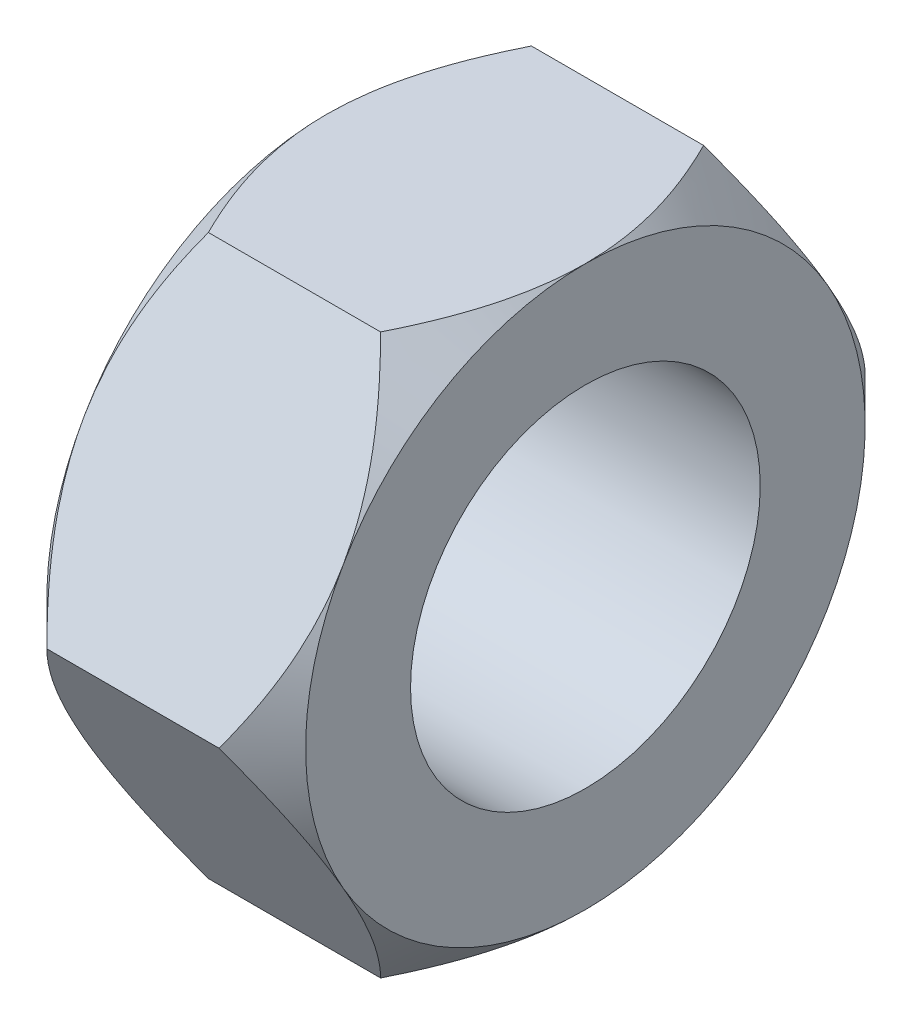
ISO-10303-21;
HEADER;
FILE_DESCRIPTION(('STEP AP214'),'2;1');
FILE_NAME('part.step','',(''),(''),'','','');
FILE_SCHEMA(('AUTOMOTIVE_DESIGN { 1 0 10303 214 1 1 1 1 }'));
ENDSEC;
DATA;
#1=APPLICATION_CONTEXT('core data for automotive mechanical design processes');
#2=APPLICATION_PROTOCOL_DEFINITION('international standard','automotive_design',2000,#1);
#3=PRODUCT_CONTEXT('',#1,'mechanical');
#4=PRODUCT('Part','Part','',(#3));
#5=PRODUCT_RELATED_PRODUCT_CATEGORY('part','',(#4));
#6=PRODUCT_DEFINITION_FORMATION('','',#4);
#7=PRODUCT_DEFINITION_CONTEXT('part definition',#1,'design');
#8=PRODUCT_DEFINITION('design','',#6,#7);
#9=PRODUCT_DEFINITION_SHAPE('','',#8);
#10=(LENGTH_UNIT() NAMED_UNIT(*) SI_UNIT(.MILLI.,.METRE.));
#11=(NAMED_UNIT(*) PLANE_ANGLE_UNIT() SI_UNIT($,.RADIAN.));
#12=(NAMED_UNIT(*) SI_UNIT($,.STERADIAN.) SOLID_ANGLE_UNIT());
#13=UNCERTAINTY_MEASURE_WITH_UNIT(LENGTH_MEASURE(1.E-05),#10,'distance_accuracy_value','');
#14=(GEOMETRIC_REPRESENTATION_CONTEXT(3) GLOBAL_UNCERTAINTY_ASSIGNED_CONTEXT((#13)) GLOBAL_UNIT_ASSIGNED_CONTEXT((#10,
#11,#12)) REPRESENTATION_CONTEXT('',''));
#15=CARTESIAN_POINT('',(0.,0.,0.));
#16=DIRECTION('',(0.,0.,1.));
#17=DIRECTION('',(1.,0.,0.));
#18=AXIS2_PLACEMENT_3D('',#15,#16,#17);
#19=CARTESIAN_POINT('',(0.,0.,0.));
#20=DIRECTION('',(1.,0.,0.));
#21=DIRECTION('',(0.,1.,0.));
#22=AXIS2_PLACEMENT_3D('',#19,#20,#21);
#23=PLANE('',#22);
#24=CARTESIAN_POINT('',(0.,-1.04645777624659E-12,-0.00155281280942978));
#25=DIRECTION('',(1.,0.,0.));
#26=DIRECTION('',(0.,-1.,0.));
#27=AXIS2_PLACEMENT_3D('',#24,#25,#26);
#28=CIRCLE('',#27,4.);
#29=CARTESIAN_POINT('',(0.,-4.00000000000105,-0.00155281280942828));
#30=VERTEX_POINT('',#29);
#31=CARTESIAN_POINT('',(0.,-2.00000000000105,-3.46565442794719));
#32=VERTEX_POINT('',#31);
#33=EDGE_CURVE('E576',#30,#32,#28,.T.);
#34=ORIENTED_EDGE('',*,*,#33,.F.);
#35=CARTESIAN_POINT('',(0.,-1.04645777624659E-12,-0.00155281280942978));
#36=DIRECTION('',(-1.,0.,0.));
#37=DIRECTION('',(0.,-1.,0.));
#38=AXIS2_PLACEMENT_3D('',#35,#36,#37);
#39=CIRCLE('',#38,4.);
#40=CARTESIAN_POINT('',(0.,-2.00000000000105,3.46254880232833));
#41=VERTEX_POINT('',#40);
#42=EDGE_CURVE('E11',#30,#41,#39,.T.);
#43=ORIENTED_EDGE('',*,*,#42,.T.);
#44=CARTESIAN_POINT('',(0.,-1.04645777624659E-12,-0.00155281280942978));
#45=DIRECTION('',(1.,0.,0.));
#46=DIRECTION('',(0.,-1.,0.));
#47=AXIS2_PLACEMENT_3D('',#44,#45,#46);
#48=CIRCLE('',#47,4.);
#49=CARTESIAN_POINT('',(0.,1.99999999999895,3.46254880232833));
#50=VERTEX_POINT('',#49);
#51=EDGE_CURVE('E32',#50,#41,#48,.T.);
#52=ORIENTED_EDGE('',*,*,#51,.F.);
#53=CARTESIAN_POINT('',(0.,-1.04645777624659E-12,-0.00155281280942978));
#54=DIRECTION('',(1.,0.,0.));
#55=DIRECTION('',(0.,-1.,0.));
#56=AXIS2_PLACEMENT_3D('',#53,#54,#55);
#57=CIRCLE('',#56,4.);
#58=CARTESIAN_POINT('',(0.,3.99999999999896,-0.00155281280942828));
#59=VERTEX_POINT('',#58);
#60=EDGE_CURVE('E130',#59,#50,#57,.T.);
#61=ORIENTED_EDGE('',*,*,#60,.F.);
#62=CARTESIAN_POINT('',(0.,-1.04645777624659E-12,-0.00155281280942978));
#63=DIRECTION('',(1.,0.,0.));
#64=DIRECTION('',(0.,-1.,0.));
#65=AXIS2_PLACEMENT_3D('',#62,#63,#64);
#66=CIRCLE('',#65,4.);
#67=CARTESIAN_POINT('',(0.,1.99999999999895,-3.46565442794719));
#68=VERTEX_POINT('',#67);
#69=EDGE_CURVE('E143',#68,#59,#66,.T.);
#70=ORIENTED_EDGE('',*,*,#69,.F.);
#71=CARTESIAN_POINT('',(0.,-1.04645777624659E-12,-0.00155281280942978));
#72=DIRECTION('',(1.,0.,0.));
#73=DIRECTION('',(0.,-1.,0.));
#74=AXIS2_PLACEMENT_3D('',#71,#72,#73);
#75=CIRCLE('',#74,4.);
#76=EDGE_CURVE('E579',#32,#68,#75,.T.);
#77=ORIENTED_EDGE('',*,*,#76,.F.);
#78=EDGE_LOOP('',(#34,#43,#52,#61,#70,#77));
#79=FACE_BOUND('',#78,.T.);
#80=CARTESIAN_POINT('',(0.,-1.04645777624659E-12,-0.00155281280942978));
#81=DIRECTION('',(1.,0.,0.));
#82=DIRECTION('',(0.,1.,0.));
#83=AXIS2_PLACEMENT_3D('',#80,#81,#82);
#84=CIRCLE('',#83,2.5);
#85=CARTESIAN_POINT('',(0.,2.49999999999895,-0.00155281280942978));
#86=VERTEX_POINT('',#85);
#87=EDGE_CURVE('E25',#86,#86,#84,.F.);
#88=ORIENTED_EDGE('',*,*,#87,.F.);
#89=EDGE_LOOP('',(#88));
#90=FACE_BOUND('',#89,.T.);
#91=ADVANCED_FACE('F17',(#79,#90),#23,.F.);
#92=CARTESIAN_POINT('',(3.69999999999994,-1.04645777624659E-12,-0.00155281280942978));
#93=DIRECTION('',(-1.,0.,0.));
#94=DIRECTION('',(0.,-1.,0.));
#95=AXIS2_PLACEMENT_3D('',#92,#93,#94);
#96=CONICAL_SURFACE('',#95,4.,0.78539816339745);
#97=CARTESIAN_POINT('',(3.69999999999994,-1.04645777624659E-12,-0.00155281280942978));
#98=DIRECTION('',(1.,0.,0.));
#99=DIRECTION('',(0.,-1.,0.));
#100=AXIS2_PLACEMENT_3D('',#97,#98,#99);
#101=CIRCLE('',#100,4.);
#102=CARTESIAN_POINT('',(3.69999999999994,-4.00000000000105,-0.00155281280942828));
#103=VERTEX_POINT('',#102);
#104=CARTESIAN_POINT('',(3.69999999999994,-2.00000000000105,-3.46565442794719));
#105=VERTEX_POINT('',#104);
#106=EDGE_CURVE('E266',#103,#105,#101,.T.);
#107=ORIENTED_EDGE('',*,*,#106,.F.);
#108=CARTESIAN_POINT('',(3.08119784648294,-4.00000000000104,-2.31095388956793));
#109=CARTESIAN_POINT('',(3.37530243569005,-4.00000000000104,-1.72274471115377));
#110=CARTESIAN_POINT('',(3.52696563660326,-4.00000000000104,-1.19076086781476));
#111=CARTESIAN_POINT('',(3.69999999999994,-4.00000000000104,-0.583814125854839));
#112=CARTESIAN_POINT('',(3.69999999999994,-4.00000000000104,-0.00155281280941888));
#113=B_SPLINE_CURVE_WITH_KNOTS('',2,(#108,#109,#110,#111,#112),.UNSPECIFIED.,.F.,.F.,(3,2,3),
(0.,0.5,1.),.UNSPECIFIED.);
#114=CARTESIAN_POINT('',(3.08119784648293,-4.00000000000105,-2.31095388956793));
#115=VERTEX_POINT('',#114);
#116=EDGE_CURVE('E319',#115,#103,#113,.T.);
#117=ORIENTED_EDGE('',*,*,#116,.F.);
#118=CARTESIAN_POINT('',(3.69999999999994,-2.00000000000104,-3.46565442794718));
#119=CARTESIAN_POINT('',(3.69999999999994,-2.50249959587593,-3.17553615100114));
#120=CARTESIAN_POINT('',(3.52789189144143,-3.02706599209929,-2.87267760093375));
#121=CARTESIAN_POINT('',(3.3764771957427,-3.48856116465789,-2.60623323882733));
#122=CARTESIAN_POINT('',(3.08119784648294,-4.00000000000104,-2.31095388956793));
#123=B_SPLINE_CURVE_WITH_KNOTS('',2,(#118,#119,#120,#121,#122),.UNSPECIFIED.,.F.,.F.,(3,2,3),
(0.,0.5,1.),.UNSPECIFIED.);
#124=EDGE_CURVE('E326',#105,#115,#123,.T.);
#125=ORIENTED_EDGE('',*,*,#124,.F.);
#126=EDGE_LOOP('',(#107,#117,#125));
#127=FACE_BOUND('',#126,.T.);
#128=ADVANCED_FACE('F189',(#127),#96,.T.);
#129=CARTESIAN_POINT('',(3.69999999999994,-1.04645777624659E-12,-0.00155281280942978));
#130=DIRECTION('',(-1.,0.,0.));
#131=DIRECTION('',(0.,-1.,0.));
#132=AXIS2_PLACEMENT_3D('',#129,#130,#131);
#133=CONICAL_SURFACE('',#132,4.,0.78539816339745);
#134=CARTESIAN_POINT('',(3.69999999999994,1.99999999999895,-3.4656544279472));
#135=CARTESIAN_POINT('',(3.69999999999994,1.49750040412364,-3.75577270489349));
#136=CARTESIAN_POINT('',(3.52789189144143,0.97293400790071,-4.05863125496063));
#137=CARTESIAN_POINT('',(3.37647719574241,0.511438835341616,-4.32507561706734));
#138=CARTESIAN_POINT('',(3.08119784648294,-1.04213512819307E-12,-4.62035496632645));
#139=B_SPLINE_CURVE_WITH_KNOTS('',2,(#134,#135,#136,#137,#138),.UNSPECIFIED.,.F.,.F.,(3,2,3),
(0.,0.5,1.),.UNSPECIFIED.);
#140=CARTESIAN_POINT('',(3.69999999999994,1.99999999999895,-3.46565442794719));
#141=VERTEX_POINT('',#140);
#142=CARTESIAN_POINT('',(3.08119784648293,-1.04515673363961E-12,-4.62035496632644));
#143=VERTEX_POINT('',#142);
#144=EDGE_CURVE('E270',#141,#143,#139,.T.);
#145=ORIENTED_EDGE('',*,*,#144,.F.);
#146=CARTESIAN_POINT('',(3.69999999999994,-1.04645777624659E-12,-0.00155281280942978));
#147=DIRECTION('',(1.,0.,0.));
#148=DIRECTION('',(0.,-1.,0.));
#149=AXIS2_PLACEMENT_3D('',#146,#147,#148);
#150=CIRCLE('',#149,4.);
#151=EDGE_CURVE('E262',#105,#141,#150,.T.);
#152=ORIENTED_EDGE('',*,*,#151,.F.);
#153=CARTESIAN_POINT('',(3.08119784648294,-1.04343617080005E-12,-4.62035496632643));
#154=CARTESIAN_POINT('',(3.37420546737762,-0.507504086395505,-4.32734734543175));
#155=CARTESIAN_POINT('',(3.525810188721,-0.966609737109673,-4.06228257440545));
#156=CARTESIAN_POINT('',(3.69999999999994,-1.4941099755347,-3.75773016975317));
#157=CARTESIAN_POINT('',(3.69999999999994,-2.00000000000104,-3.46565442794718));
#158=B_SPLINE_CURVE_WITH_KNOTS('',2,(#153,#154,#155,#156,#157),.UNSPECIFIED.,.F.,.F.,(3,2,3),
(0.,0.5,1.),.UNSPECIFIED.);
#159=EDGE_CURVE('E331',#143,#105,#158,.T.);
#160=ORIENTED_EDGE('',*,*,#159,.F.);
#161=EDGE_LOOP('',(#145,#152,#160));
#162=FACE_BOUND('',#161,.T.);
#163=ADVANCED_FACE('F394',(#162),#133,.T.);
#164=CARTESIAN_POINT('',(3.69999999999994,-1.04645777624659E-12,-0.00155281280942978));
#165=DIRECTION('',(-1.,0.,0.));
#166=DIRECTION('',(0.,-1.,0.));
#167=AXIS2_PLACEMENT_3D('',#164,#165,#166);
#168=CONICAL_SURFACE('',#167,4.,0.78539816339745);
#169=CARTESIAN_POINT('',(3.69999999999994,-1.04645777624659E-12,-0.00155281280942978));
#170=DIRECTION('',(1.,0.,0.));
#171=DIRECTION('',(0.,-1.,0.));
#172=AXIS2_PLACEMENT_3D('',#169,#170,#171);
#173=CIRCLE('',#172,4.);
#174=CARTESIAN_POINT('',(3.69999999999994,3.99999999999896,-0.00155281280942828));
#175=VERTEX_POINT('',#174);
#176=EDGE_CURVE('E258',#141,#175,#173,.T.);
#177=ORIENTED_EDGE('',*,*,#176,.F.);
#178=CARTESIAN_POINT('',(3.08119784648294,3.99999999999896,-2.31095388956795));
#179=CARTESIAN_POINT('',(3.37420546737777,3.49249591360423,-2.60396151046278));
#180=CARTESIAN_POINT('',(3.525810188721,3.03339026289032,-2.86902628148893));
#181=CARTESIAN_POINT('',(3.69999999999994,2.50589002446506,-3.17357868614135));
#182=CARTESIAN_POINT('',(3.69999999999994,1.99999999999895,-3.4656544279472));
#183=B_SPLINE_CURVE_WITH_KNOTS('',2,(#178,#179,#180,#181,#182),.UNSPECIFIED.,.F.,.F.,(3,2,3),
(0.,0.5,1.),.UNSPECIFIED.);
#184=CARTESIAN_POINT('',(3.08119784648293,3.99999999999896,-2.31095388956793));
#185=VERTEX_POINT('',#184);
#186=EDGE_CURVE('E275',#185,#141,#183,.T.);
#187=ORIENTED_EDGE('',*,*,#186,.F.);
#188=CARTESIAN_POINT('',(3.69999999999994,3.99999999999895,-0.00155281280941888));
#189=CARTESIAN_POINT('',(3.69999999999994,3.99999999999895,-0.58332473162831));
#190=CARTESIAN_POINT('',(3.52696563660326,3.99999999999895,-1.19076086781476));
#191=CARTESIAN_POINT('',(3.37558641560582,3.99999999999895,-1.72217675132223));
#192=CARTESIAN_POINT('',(3.08119784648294,3.99999999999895,-2.31095388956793));
#193=B_SPLINE_CURVE_WITH_KNOTS('',2,(#188,#189,#190,#191,#192),.UNSPECIFIED.,.F.,.F.,(3,2,3),
(0.,0.5,1.),.UNSPECIFIED.);
#194=EDGE_CURVE('E282',#175,#185,#193,.T.);
#195=ORIENTED_EDGE('',*,*,#194,.F.);
#196=EDGE_LOOP('',(#177,#187,#195));
#197=FACE_BOUND('',#196,.T.);
#198=ADVANCED_FACE('F403',(#197),#168,.T.);
#199=CARTESIAN_POINT('',(3.69999999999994,-1.04645777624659E-12,-0.00155281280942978));
#200=DIRECTION('',(-1.,0.,0.));
#201=DIRECTION('',(0.,-1.,0.));
#202=AXIS2_PLACEMENT_3D('',#199,#200,#201);
#203=CONICAL_SURFACE('',#202,4.,0.78539816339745);
#204=CARTESIAN_POINT('',(3.69999999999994,-1.04645777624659E-12,-0.00155281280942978));
#205=DIRECTION('',(1.,0.,0.));
#206=DIRECTION('',(0.,-1.,0.));
#207=AXIS2_PLACEMENT_3D('',#204,#205,#206);
#208=CIRCLE('',#207,4.);
#209=CARTESIAN_POINT('',(3.69999999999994,1.99999999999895,3.46254880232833));
#210=VERTEX_POINT('',#209);
#211=EDGE_CURVE('E254',#175,#210,#208,.T.);
#212=ORIENTED_EDGE('',*,*,#211,.F.);
#213=CARTESIAN_POINT('',(3.08119784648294,3.99999999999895,2.30784826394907));
#214=CARTESIAN_POINT('',(3.3755036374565,3.99999999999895,1.71923668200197));
#215=CARTESIAN_POINT('',(3.52717771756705,3.99999999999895,1.18691081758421));
#216=CARTESIAN_POINT('',(3.69999999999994,3.99999999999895,0.580361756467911));
#217=CARTESIAN_POINT('',(3.69999999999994,3.99999999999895,-0.00155281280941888));
#218=B_SPLINE_CURVE_WITH_KNOTS('',2,(#213,#214,#215,#216,#217),.UNSPECIFIED.,.F.,.F.,(3,2,3),
(0.,0.5,1.),.UNSPECIFIED.);
#219=CARTESIAN_POINT('',(3.08119784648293,3.99999999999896,2.30784826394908));
#220=VERTEX_POINT('',#219);
#221=EDGE_CURVE('E287',#220,#175,#218,.T.);
#222=ORIENTED_EDGE('',*,*,#221,.F.);
#223=CARTESIAN_POINT('',(3.69999999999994,1.99999999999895,3.46254880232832));
#224=CARTESIAN_POINT('',(3.69999999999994,2.50249959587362,3.1724305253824));
#225=CARTESIAN_POINT('',(3.52789189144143,3.0270659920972,2.86957197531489));
#226=CARTESIAN_POINT('',(3.37647719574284,3.48856116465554,2.60312761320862));
#227=CARTESIAN_POINT('',(3.08119784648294,3.99999999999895,2.30784826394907));
#228=B_SPLINE_CURVE_WITH_KNOTS('',2,(#223,#224,#225,#226,#227),.UNSPECIFIED.,.F.,.F.,(3,2,3),
(0.,0.5,1.),.UNSPECIFIED.);
#229=EDGE_CURVE('E293',#210,#220,#228,.T.);
#230=ORIENTED_EDGE('',*,*,#229,.F.);
#231=EDGE_LOOP('',(#212,#222,#230));
#232=FACE_BOUND('',#231,.T.);
#233=ADVANCED_FACE('F411',(#232),#203,.T.);
#234=CARTESIAN_POINT('',(3.69999999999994,-1.04645777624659E-12,-0.00155281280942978));
#235=DIRECTION('',(-1.,0.,0.));
#236=DIRECTION('',(0.,-1.,0.));
#237=AXIS2_PLACEMENT_3D('',#234,#235,#236);
#238=CONICAL_SURFACE('',#237,4.,0.78539816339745);
#239=CARTESIAN_POINT('',(3.69999999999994,-1.04645777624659E-12,-0.00155281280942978));
#240=DIRECTION('',(1.,0.,0.));
#241=DIRECTION('',(0.,-1.,0.));
#242=AXIS2_PLACEMENT_3D('',#239,#240,#241);
#243=CIRCLE('',#242,4.);
#244=CARTESIAN_POINT('',(3.69999999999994,-2.00000000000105,3.46254880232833));
#245=VERTEX_POINT('',#244);
#246=EDGE_CURVE('E249',#210,#245,#243,.T.);
#247=ORIENTED_EDGE('',*,*,#246,.F.);
#248=CARTESIAN_POINT('',(3.08119784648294,-1.04950770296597E-12,4.61724934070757));
#249=CARTESIAN_POINT('',(3.37420546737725,0.507504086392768,4.32424171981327));
#250=CARTESIAN_POINT('',(3.525810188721,0.966609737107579,4.05917694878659));
#251=CARTESIAN_POINT('',(3.69999999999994,1.49410997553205,3.75462454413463));
#252=CARTESIAN_POINT('',(3.69999999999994,1.99999999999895,3.46254880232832));
#253=B_SPLINE_CURVE_WITH_KNOTS('',2,(#248,#249,#250,#251,#252),.UNSPECIFIED.,.F.,.F.,(3,2,3),
(0.,0.5,1.),.UNSPECIFIED.);
#254=CARTESIAN_POINT('',(3.08119784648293,-1.04656480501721E-12,4.61724934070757));
#255=VERTEX_POINT('',#254);
#256=EDGE_CURVE('E297',#255,#210,#253,.T.);
#257=ORIENTED_EDGE('',*,*,#256,.F.);
#258=CARTESIAN_POINT('',(3.69999999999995,-2.00000000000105,3.46254880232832));
#259=CARTESIAN_POINT('',(3.69999999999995,-1.49750040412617,3.75266707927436));
#260=CARTESIAN_POINT('',(3.52789189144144,-0.972934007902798,4.05552562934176));
#261=CARTESIAN_POINT('',(3.37647719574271,-0.511438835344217,4.32196999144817));
#262=CARTESIAN_POINT('',(3.08119784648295,-1.05037506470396E-12,4.61724934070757));
#263=B_SPLINE_CURVE_WITH_KNOTS('',2,(#258,#259,#260,#261,#262),.UNSPECIFIED.,.F.,.F.,(3,2,3),
(0.,0.5,1.),.UNSPECIFIED.);
#264=EDGE_CURVE('E303',#245,#255,#263,.T.);
#265=ORIENTED_EDGE('',*,*,#264,.F.);
#266=EDGE_LOOP('',(#247,#257,#265));
#267=FACE_BOUND('',#266,.T.);
#268=ADVANCED_FACE('F420',(#267),#238,.T.);
#269=CARTESIAN_POINT('',(3.69999999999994,-1.04645777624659E-12,-0.00155281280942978));
#270=DIRECTION('',(-1.,0.,0.));
#271=DIRECTION('',(0.,-1.,0.));
#272=AXIS2_PLACEMENT_3D('',#269,#270,#271);
#273=CONICAL_SURFACE('',#272,4.,0.78539816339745);
#274=CARTESIAN_POINT('',(3.69999999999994,-1.04645777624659E-12,-0.00155281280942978));
#275=DIRECTION('',(-1.,0.,0.));
#276=DIRECTION('',(0.,-1.,0.));
#277=AXIS2_PLACEMENT_3D('',#274,#275,#276);
#278=CIRCLE('',#277,4.);
#279=EDGE_CURVE('E241',#103,#245,#278,.T.);
#280=ORIENTED_EDGE('',*,*,#279,.T.);
#281=CARTESIAN_POINT('',(3.08119784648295,-4.00000000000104,2.30784826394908));
#282=CARTESIAN_POINT('',(3.37420546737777,-3.49249591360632,2.60085588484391));
#283=CARTESIAN_POINT('',(3.52581018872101,-3.03339026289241,2.86592065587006));
#284=CARTESIAN_POINT('',(3.69999999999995,-2.50589002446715,3.17047306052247));
#285=CARTESIAN_POINT('',(3.69999999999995,-2.00000000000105,3.46254880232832));
#286=B_SPLINE_CURVE_WITH_KNOTS('',2,(#281,#282,#283,#284,#285),.UNSPECIFIED.,.F.,.F.,(3,2,3),
(0.,0.5,1.),.UNSPECIFIED.);
#287=CARTESIAN_POINT('',(3.08119784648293,-4.00000000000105,2.30784826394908));
#288=VERTEX_POINT('',#287);
#289=EDGE_CURVE('E307',#288,#245,#286,.T.);
#290=ORIENTED_EDGE('',*,*,#289,.F.);
#291=CARTESIAN_POINT('',(3.69999999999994,-4.00000000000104,-0.00155281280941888));
#292=CARTESIAN_POINT('',(3.69999999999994,-4.00000000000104,0.579865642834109));
#293=CARTESIAN_POINT('',(3.52717771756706,-4.00000000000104,1.18691081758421));
#294=CARTESIAN_POINT('',(3.37579150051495,-4.00000000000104,1.71866095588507));
#295=CARTESIAN_POINT('',(3.08119784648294,-4.00000000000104,2.30784826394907));
#296=B_SPLINE_CURVE_WITH_KNOTS('',2,(#291,#292,#293,#294,#295),.UNSPECIFIED.,.F.,.F.,(3,2,3),
(0.,0.5,1.),.UNSPECIFIED.);
#297=EDGE_CURVE('E314',#103,#288,#296,.T.);
#298=ORIENTED_EDGE('',*,*,#297,.F.);
#299=EDGE_LOOP('',(#280,#290,#298));
#300=FACE_BOUND('',#299,.T.);
#301=ADVANCED_FACE('F429',(#300),#273,.T.);
#302=CARTESIAN_POINT('',(0.,-2.17706036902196,-5.87728135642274));
#303=DIRECTION('',(0.,-0.5,0.866025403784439));
#304=DIRECTION('',(1.,0.,0.));
#305=AXIS2_PLACEMENT_3D('',#302,#303,#304);
#306=PLANE('',#305);
#307=CARTESIAN_POINT('',(0.618802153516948,3.99999999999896,-2.31095388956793));
#308=CARTESIAN_POINT('',(0.587203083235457,3.94526384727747,-2.34255546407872));
#309=CARTESIAN_POINT('',(0.556368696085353,3.89018646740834,-2.37434346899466));
#310=CARTESIAN_POINT('',(0.497184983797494,3.78071126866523,-2.43752122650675));
#311=CARTESIAN_POINT('',(0.468792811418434,3.72633086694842,-2.46890107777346));
#312=CARTESIAN_POINT('',(0.414489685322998,3.61815075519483,-2.53133367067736));
#313=CARTESIAN_POINT('',(0.388536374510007,3.56436696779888,-2.56237703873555));
#314=CARTESIAN_POINT('',(0.339111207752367,3.45727051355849,-2.62420626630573));
#315=CARTESIAN_POINT('',(0.315598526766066,3.40397187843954,-2.65498372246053));
#316=CARTESIAN_POINT('',(0.271052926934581,3.2977224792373,-2.71635038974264));
#317=CARTESIAN_POINT('',(0.249982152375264,3.24478354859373,-2.74693253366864));
#318=CARTESIAN_POINT('',(0.210315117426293,3.13911596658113,-2.80797079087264));
#319=CARTESIAN_POINT('',(0.191685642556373,3.08639671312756,-2.83842154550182));
#320=CARTESIAN_POINT('',(0.155582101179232,2.97701519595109,-2.90157598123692));
#321=CARTESIAN_POINT('',(0.138256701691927,2.92031526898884,-2.93429985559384));
#322=CARTESIAN_POINT('',(0.106675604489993,2.80724518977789,-2.9995697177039));
#323=CARTESIAN_POINT('',(0.0923750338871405,2.75088439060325,-3.03211010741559));
#324=CARTESIAN_POINT('',(0.066831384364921,2.63827553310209,-3.09713665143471));
#325=CARTESIAN_POINT('',(0.0555572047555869,2.58203273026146,-3.12961965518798));
#326=CARTESIAN_POINT('',(0.0356727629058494,2.46725558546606,-3.19588224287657));
#327=CARTESIAN_POINT('',(0.0271642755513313,2.40870754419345,-3.22966883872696));
#328=CARTESIAN_POINT('',(0.0135870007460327,2.29183246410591,-3.29713245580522));
#329=CARTESIAN_POINT('',(0.00848899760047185,2.2335079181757,-3.33080788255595));
#330=CARTESIAN_POINT('',(0.00168839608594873,2.11678963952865,-3.39820682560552));
#331=CARTESIAN_POINT('',(-1.85550231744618E-05,2.05839609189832,-3.43193022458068));
#332=CARTESIAN_POINT('',(0.,1.99999999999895,-3.46565442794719));
#333=B_SPLINE_CURVE_WITH_KNOTS('',3,(#307,#308,#309,#310,#311,#312,#313,#314,#315,#316,#317,
#318,#319,#320,#321,#322,#323,#324,#325,#326,#327,#328,#329,#330,#331,#332),.UNSPECIFIED.,.F.,
.F.,(4,2,2,2,2,2,2,2,2,2,2,2,4),(0.,0.211991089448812,0.418684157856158,0.620568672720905,
0.818190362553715,1.01215269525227,1.2031169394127,1.4062171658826,1.60605219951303,
1.8037473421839,2.0080584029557,2.21059603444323,2.41287352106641),.UNSPECIFIED.);
#334=CARTESIAN_POINT('',(0.618802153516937,3.99999999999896,-2.31095388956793));
#335=VERTEX_POINT('',#334);
#336=EDGE_CURVE('E158',#335,#68,#333,.T.);
#337=ORIENTED_EDGE('',*,*,#336,.F.);
#338=DIRECTION('',(1.,0.,0.));
#339=VECTOR('',#338,1.);
#340=CARTESIAN_POINT('',(0.,3.99999999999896,-2.31095388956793));
#341=LINE('',#340,#339);
#342=EDGE_CURVE('E279',#335,#185,#341,.T.);
#343=ORIENTED_EDGE('',*,*,#342,.T.);
#344=ORIENTED_EDGE('',*,*,#186,.T.);
#345=ORIENTED_EDGE('',*,*,#144,.T.);
#346=DIRECTION('',(1.,0.,0.));
#347=VECTOR('',#346,1.);
#348=CARTESIAN_POINT('',(0.,-1.04515673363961E-12,-4.62035496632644));
#349=LINE('',#348,#347);
#350=CARTESIAN_POINT('',(0.618802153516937,-1.04499051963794E-12,-4.62035496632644));
#351=VERTEX_POINT('',#350);
#352=EDGE_CURVE('E147',#351,#143,#349,.T.);
#353=ORIENTED_EDGE('',*,*,#352,.F.);
#354=CARTESIAN_POINT('',(0.,1.99999999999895,-3.46565442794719));
#355=CARTESIAN_POINT('',(-1.77233312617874E-05,1.94256608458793,-3.49880488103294));
#356=CARTESIAN_POINT('',(0.00164238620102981,1.88513951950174,-3.53196180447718));
#357=CARTESIAN_POINT('',(0.00824831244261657,1.77028547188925,-3.59829030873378));
#358=CARTESIAN_POINT('',(0.0132025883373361,1.71285836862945,-3.63146170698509));
#359=CARTESIAN_POINT('',(0.0263907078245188,1.59772186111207,-3.69797447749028));
#360=CARTESIAN_POINT('',(0.0346563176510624,1.54001523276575,-3.73131431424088));
#361=CARTESIAN_POINT('',(0.0541412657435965,1.42581369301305,-3.79724851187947));
#362=CARTESIAN_POINT('',(0.0653160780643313,1.36931333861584,-3.829846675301));
#363=CARTESIAN_POINT('',(0.0906757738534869,1.25624896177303,-3.89508684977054));
#364=CARTESIAN_POINT('',(0.104889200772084,1.19968978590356,-3.92772613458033));
#365=CARTESIAN_POINT('',(0.136310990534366,1.08628696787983,-3.99318801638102));
#366=CARTESIAN_POINT('',(0.153562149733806,1.02945238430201,-4.02600568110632));
#367=CARTESIAN_POINT('',(0.189615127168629,0.91958177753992,-4.089429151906));
#368=CARTESIAN_POINT('',(0.208275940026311,0.866511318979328,-4.12005587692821));
#369=CARTESIAN_POINT('',(0.248038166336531,0.760135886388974,-4.18143922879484));
#370=CARTESIAN_POINT('',(0.269173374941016,0.706840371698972,-4.21219031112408));
#371=CARTESIAN_POINT('',(0.313881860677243,0.599884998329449,-4.27391638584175));
#372=CARTESIAN_POINT('',(0.337493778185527,0.546237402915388,-4.30488456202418));
#373=CARTESIAN_POINT('',(0.387150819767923,0.438448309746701,-4.36712058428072));
#374=CARTESIAN_POINT('',(0.41323765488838,0.3843213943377,-4.39838032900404));
#375=CARTESIAN_POINT('',(0.467841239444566,0.275452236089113,-4.46126316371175));
#376=CARTESIAN_POINT('',(0.496401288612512,0.22072641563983,-4.49287696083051));
#377=CARTESIAN_POINT('',(0.555954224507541,0.110543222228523,-4.55652085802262));
#378=CARTESIAN_POINT('',(0.58699091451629,0.0551035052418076,-4.58854059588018));
#379=CARTESIAN_POINT('',(0.618802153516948,-1.05391965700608E-12,-4.62035496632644));
#380=B_SPLINE_CURVE_WITH_KNOTS('',3,(#354,#355,#356,#357,#358,#359,#360,#361,#362,#363,#364,
#365,#366,#367,#368,#369,#370,#371,#372,#373,#374,#375,#376,#377,#378,#379),.UNSPECIFIED.,.F.,
.F.,(4,2,2,2,2,2,2,2,2,2,2,2,4),(0.,0.198917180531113,0.398347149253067,0.599737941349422,
0.798211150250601,0.998637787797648,1.2021545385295,1.39427032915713,1.58941036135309,
1.78825171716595,1.9914120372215,2.19944955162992,2.41286459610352),.UNSPECIFIED.);
#381=EDGE_CURVE('E226',#68,#351,#380,.T.);
#382=ORIENTED_EDGE('',*,*,#381,.F.);
#383=EDGE_LOOP('',(#337,#343,#344,#345,#353,#382));
#384=FACE_BOUND('',#383,.T.);
#385=ADVANCED_FACE('F438',(#384),#306,.F.);
#386=CARTESIAN_POINT('',(0.,3.99999999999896,-9.64806052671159));
#387=DIRECTION('',(0.,-1.,0.));
#388=DIRECTION('',(-1.,0.,0.));
#389=AXIS2_PLACEMENT_3D('',#386,#387,#388);
#390=PLANE('',#389);
#391=CARTESIAN_POINT('',(0.618802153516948,3.99999999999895,2.30784826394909));
#392=CARTESIAN_POINT('',(0.587065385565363,3.99999969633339,2.24436906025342));
#393=CARTESIAN_POINT('',(0.556099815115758,3.99999001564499,2.18049775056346));
#394=CARTESIAN_POINT('',(0.496676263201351,3.99996542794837,2.05355006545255));
#395=CARTESIAN_POINT('',(0.468174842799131,3.99995065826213,1.99049399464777));
#396=CARTESIAN_POINT('',(0.413675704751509,3.99992836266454,1.8650538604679));
#397=CARTESIAN_POINT('',(0.387635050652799,3.99992067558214,1.80268851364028));
#398=CARTESIAN_POINT('',(0.33805754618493,3.99991800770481,1.67849830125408));
#399=CARTESIAN_POINT('',(0.31447933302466,3.99992276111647,1.61668998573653));
#400=CARTESIAN_POINT('',(0.269825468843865,3.99994384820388,1.49347025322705));
#401=CARTESIAN_POINT('',(0.248711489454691,3.99995996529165,1.43207276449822));
#402=CARTESIAN_POINT('',(0.20897892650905,3.99998653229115,1.30952269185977));
#403=CARTESIAN_POINT('',(0.190326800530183,3.99999706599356,1.24838100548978));
#404=CARTESIAN_POINT('',(0.154271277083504,4.00000310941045,1.12176570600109));
#405=CARTESIAN_POINT('',(0.137009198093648,3.99999768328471,1.05625164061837));
#406=CARTESIAN_POINT('',(0.105554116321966,4.00000389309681,0.925542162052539));
#407=CARTESIAN_POINT('',(0.091318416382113,4.00001527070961,0.860357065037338));
#408=CARTESIAN_POINT('',(0.0659019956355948,4.00004371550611,0.730055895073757));
#409=CARTESIAN_POINT('',(0.0546926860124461,4.00006072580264,0.664945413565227));
#410=CARTESIAN_POINT('',(0.0350549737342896,4.00005913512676,0.532824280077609));
#411=CARTESIAN_POINT('',(0.0266939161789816,4.00003973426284,0.46580355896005));
#412=CARTESIAN_POINT('',(0.0133534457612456,4.0000102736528,0.332066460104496));
#413=CARTESIAN_POINT('',(0.00834270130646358,4.00000012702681,0.265353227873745));
#414=CARTESIAN_POINT('',(0.00166071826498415,3.99999110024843,0.131909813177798));
#415=CARTESIAN_POINT('',(-1.79595110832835E-05,3.99999219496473,0.0651800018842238));
#416=CARTESIAN_POINT('',(0.,3.99999999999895,-0.00155281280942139));
#417=B_SPLINE_CURVE_WITH_KNOTS('',3,(#391,#392,#393,#394,#395,#396,#397,#398,#399,#400,#401,
#402,#403,#404,#405,#406,#407,#408,#409,#410,#411,#412,#413,#414,#415,#416),.UNSPECIFIED.,.F.,
.F.,(4,2,2,2,2,2,2,2,2,2,2,2,4),(0.,0.212915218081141,0.420484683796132,0.623204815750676,
0.821629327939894,1.01637072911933,1.20810036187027,1.41129232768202,1.61139294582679,
1.80953133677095,2.01207351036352,2.2126940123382,2.41286610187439),.UNSPECIFIED.);
#418=CARTESIAN_POINT('',(0.618802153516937,3.99999999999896,2.30784826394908));
#419=VERTEX_POINT('',#418);
#420=EDGE_CURVE('E137',#419,#59,#417,.T.);
#421=ORIENTED_EDGE('',*,*,#420,.F.);
#422=DIRECTION('',(1.,0.,0.));
#423=VECTOR('',#422,1.);
#424=CARTESIAN_POINT('',(0.,3.99999999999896,2.30784826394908));
#425=LINE('',#424,#423);
#426=EDGE_CURVE('E156',#419,#220,#425,.T.);
#427=ORIENTED_EDGE('',*,*,#426,.T.);
#428=ORIENTED_EDGE('',*,*,#221,.T.);
#429=ORIENTED_EDGE('',*,*,#194,.T.);
#430=ORIENTED_EDGE('',*,*,#342,.F.);
#431=CARTESIAN_POINT('',(0.,3.99999999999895,-0.00155281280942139));
#432=CARTESIAN_POINT('',(-1.83483754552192E-05,3.99999199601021,-0.0686088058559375));
#433=CARTESIAN_POINT('',(0.00167010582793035,3.99998427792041,-0.135662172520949));
#434=CARTESIAN_POINT('',(0.00839640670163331,3.99997572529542,-0.269693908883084));
#435=CARTESIAN_POINT('',(0.013438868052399,3.99997490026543,-0.33667204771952));
#436=CARTESIAN_POINT('',(0.0268672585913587,3.99998655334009,-0.470883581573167));
#437=CARTESIAN_POINT('',(0.035282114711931,3.99999914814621,-0.538114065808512));
#438=CARTESIAN_POINT('',(0.0549897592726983,4.00000082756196,-0.670189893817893));
#439=CARTESIAN_POINT('',(0.0661936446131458,3.99999057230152,-0.73504858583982));
#440=CARTESIAN_POINT('',(0.0915941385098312,3.99998106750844,-0.86491513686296));
#441=CARTESIAN_POINT('',(0.105822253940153,3.99998194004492,-0.929916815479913));
#442=CARTESIAN_POINT('',(0.137254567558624,3.99999249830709,-1.06032885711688));
#443=CARTESIAN_POINT('',(0.154503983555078,4.00000232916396,-1.12572827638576));
#444=CARTESIAN_POINT('',(0.190536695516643,3.99999780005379,-1.25218551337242));
#445=CARTESIAN_POINT('',(0.209181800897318,3.99998475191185,-1.31328290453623));
#446=CARTESIAN_POINT('',(0.248899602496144,3.99995586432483,-1.43574551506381));
#447=CARTESIAN_POINT('',(0.270005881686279,3.99993998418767,-1.49709982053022));
#448=CARTESIAN_POINT('',(0.31464138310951,3.99991926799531,-1.62023472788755));
#449=CARTESIAN_POINT('',(0.33820891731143,3.99991464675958,-1.68200140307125));
#450=CARTESIAN_POINT('',(0.387762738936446,3.99991793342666,-1.80610946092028));
#451=CARTESIAN_POINT('',(0.413790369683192,3.99992611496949,-1.86843429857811));
#452=CARTESIAN_POINT('',(0.468260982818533,3.99994934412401,-1.99379438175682));
#453=CARTESIAN_POINT('',(0.496746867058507,3.99996455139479,-2.05681092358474));
#454=CARTESIAN_POINT('',(0.556136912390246,3.99998979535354,-2.18368031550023));
#455=CARTESIAN_POINT('',(0.587084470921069,3.99999968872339,-2.24751287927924));
#456=CARTESIAN_POINT('',(0.618802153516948,3.99999999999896,-2.31095388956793));
#457=B_SPLINE_CURVE_WITH_KNOTS('',3,(#431,#432,#433,#434,#435,#436,#437,#438,#439,#440,#441,
#442,#443,#444,#445,#446,#447,#448,#449,#450,#451,#452,#453,#454,#455,#456),.UNSPECIFIED.,.F.,
.F.,(4,2,2,2,2,2,2,2,2,2,2,2,4),(0.,0.201141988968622,0.402561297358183,0.605746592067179,
0.803138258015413,1.00269710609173,1.20554756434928,1.39714407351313,1.59175547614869,
1.79005194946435,1.99264493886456,2.2000872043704,2.41287432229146),.UNSPECIFIED.);
#458=EDGE_CURVE('E223',#59,#335,#457,.T.);
#459=ORIENTED_EDGE('',*,*,#458,.F.);
#460=EDGE_LOOP('',(#421,#427,#428,#429,#430,#459));
#461=FACE_BOUND('',#460,.T.);
#462=ADVANCED_FACE('F455',(#461),#390,.F.);
#463=CARTESIAN_POINT('',(0.,6.17706036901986,1.05092187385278));
#464=DIRECTION('',(0.,-0.5,-0.866025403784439));
#465=DIRECTION('',(1.,0.,0.));
#466=AXIS2_PLACEMENT_3D('',#463,#464,#465);
#467=PLANE('',#466);
#468=CARTESIAN_POINT('',(0.618802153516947,-1.04560931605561E-12,4.61724934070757));
#469=CARTESIAN_POINT('',(0.58720308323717,0.0547358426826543,4.58564722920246));
#470=CARTESIAN_POINT('',(0.556368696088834,0.109803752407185,4.55384282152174));
#471=CARTESIAN_POINT('',(0.497184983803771,0.219254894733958,4.49062339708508));
#472=CARTESIAN_POINT('',(0.468792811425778,0.2736208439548,4.45921851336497));
#473=CARTESIAN_POINT('',(0.414489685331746,0.381779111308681,4.39674808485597));
#474=CARTESIAN_POINT('',(0.388536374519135,0.435555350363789,4.36569164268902));
#475=CARTESIAN_POINT('',(0.339111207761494,0.542649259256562,4.30385800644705));
#476=CARTESIAN_POINT('',(0.315598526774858,0.595952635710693,4.27308876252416));
#477=CARTESIAN_POINT('',(0.27105292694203,0.702222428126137,4.21175741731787));
#478=CARTESIAN_POINT('',(0.249982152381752,0.75517680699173,4.18120203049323));
#479=CARTESIAN_POINT('',(0.210315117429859,0.860871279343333,4.12021034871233));
#480=CARTESIAN_POINT('',(0.191685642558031,0.913602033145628,4.0897795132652));
#481=CARTESIAN_POINT('',(0.155582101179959,1.02298613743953,4.02662955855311));
#482=CARTESIAN_POINT('',(0.138256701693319,1.07967580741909,3.99388791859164));
#483=CARTESIAN_POINT('',(0.106675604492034,1.19273620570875,3.92860128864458));
#484=CARTESIAN_POINT('',(0.0923750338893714,1.24909740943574,3.89606159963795));
#485=CARTESIAN_POINT('',(0.0668313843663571,1.36171647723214,3.83105274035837));
#486=CARTESIAN_POINT('',(0.0555572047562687,1.41796898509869,3.79858654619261));
#487=CARTESIAN_POINT('',(0.0356727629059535,1.53274264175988,3.73231791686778));
#488=CARTESIAN_POINT('',(0.0271642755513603,1.59127671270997,3.69850712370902));
#489=CARTESIAN_POINT('',(0.0135870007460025,1.70813945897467,3.63102214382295));
#490=CARTESIAN_POINT('',(0.00848899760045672,1.76646550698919,3.59734931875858));
#491=CARTESIAN_POINT('',(0.0016883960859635,1.88319384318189,3.52996779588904));
#492=CARTESIAN_POINT('',(-1.85550231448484E-05,1.94159593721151,3.49625919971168));
#493=CARTESIAN_POINT('',(0.,1.99999999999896,3.46254880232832));
#494=B_SPLINE_CURVE_WITH_KNOTS('',3,(#468,#469,#470,#471,#472,#473,#474,#475,#476,#477,#478,
#479,#480,#481,#482,#483,#484,#485,#486,#487,#488,#489,#490,#491,#492,#493),.UNSPECIFIED.,.F.,
.F.,(4,2,2,2,2,2,2,2,2,2,2,2,4),(0.,0.211991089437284,0.418684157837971,0.620568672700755,
0.818190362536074,1.01215269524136,1.20311693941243,1.40621716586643,1.60605219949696,
1.80374734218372,2.00805840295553,2.21059603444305,2.41287352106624),.UNSPECIFIED.);
#495=CARTESIAN_POINT('',(0.618802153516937,-1.04661736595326E-12,4.61724934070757));
#496=VERTEX_POINT('',#495);
#497=EDGE_CURVE('E153',#496,#50,#494,.T.);
#498=ORIENTED_EDGE('',*,*,#497,.F.);
#499=DIRECTION('',(1.,0.,0.));
#500=VECTOR('',#499,1.);
#501=CARTESIAN_POINT('',(0.,-1.04645777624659E-12,4.61724934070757));
#502=LINE('',#501,#500);
#503=EDGE_CURVE('E211',#496,#255,#502,.T.);
#504=ORIENTED_EDGE('',*,*,#503,.T.);
#505=ORIENTED_EDGE('',*,*,#256,.T.);
#506=ORIENTED_EDGE('',*,*,#229,.T.);
#507=ORIENTED_EDGE('',*,*,#426,.F.);
#508=CARTESIAN_POINT('',(0.,1.99999999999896,3.46254880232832));
#509=CARTESIAN_POINT('',(-1.77233312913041E-05,2.05742609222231,3.42938479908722));
#510=CARTESIAN_POINT('',(0.00164238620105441,2.11485411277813,3.39623039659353));
#511=CARTESIAN_POINT('',(0.00824831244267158,2.22972330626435,3.32992812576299));
#512=CARTESIAN_POINT('',(0.0132025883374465,2.287164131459,3.29678049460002));
#513=CARTESIAN_POINT('',(0.026390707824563,2.40233413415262,3.23032573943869));
#514=CARTESIAN_POINT('',(0.034656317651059,2.46006059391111,3.19702025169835));
#515=CARTESIAN_POINT('',(0.0541412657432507,2.57426205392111,3.13108591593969));
#516=CARTESIAN_POINT('',(0.0653160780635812,2.63074306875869,3.09845425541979));
#517=CARTESIAN_POINT('',(0.0906757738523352,2.74377490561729,3.03315772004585));
#518=CARTESIAN_POINT('',(0.104889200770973,2.80032094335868,3.00049567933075));
#519=CARTESIAN_POINT('',(0.136310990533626,2.91371400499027,2.93501689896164));
#520=CARTESIAN_POINT('',(0.153562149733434,2.97055222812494,2.90220553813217));
#521=CARTESIAN_POINT('',(0.189615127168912,3.08041386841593,2.83876653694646));
#522=CARTESIAN_POINT('',(0.208275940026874,3.13347261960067,2.80811953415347));
#523=CARTESIAN_POINT('',(0.248038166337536,3.23981987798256,2.74668738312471));
#524=CARTESIAN_POINT('',(0.269173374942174,3.29309885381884,2.71590765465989));
#525=CARTESIAN_POINT('',(0.313881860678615,3.40003288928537,2.65414462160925));
#526=CARTESIAN_POINT('',(0.33749377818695,3.45367591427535,2.62316852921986));
#527=CARTESIAN_POINT('',(0.387150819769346,3.56146843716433,2.56093844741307));
#528=CARTESIAN_POINT('',(0.413237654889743,3.61560362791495,2.52969303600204));
#529=CARTESIAN_POINT('',(0.467841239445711,3.72449633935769,2.46685099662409));
#530=CARTESIAN_POINT('',(0.496401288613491,3.77923760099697,2.43526394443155));
#531=CARTESIAN_POINT('',(0.555954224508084,3.88944642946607,2.37166444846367));
#532=CARTESIAN_POINT('',(0.586990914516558,3.94489619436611,2.33966211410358));
#533=CARTESIAN_POINT('',(0.618802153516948,3.99999999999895,2.30784826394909));
#534=B_SPLINE_CURVE_WITH_KNOTS('',3,(#508,#509,#510,#511,#512,#513,#514,#515,#516,#517,#518,
#519,#520,#521,#522,#523,#524,#525,#526,#527,#528,#529,#530,#531,#532,#533),.UNSPECIFIED.,.F.,
.F.,(4,2,2,2,2,2,2,2,2,2,2,2,4),(0.,0.198917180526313,0.398347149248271,0.599737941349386,
0.798211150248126,0.998637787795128,1.20215453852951,1.39427032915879,1.58941036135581,
1.78825171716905,1.99141203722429,2.19944955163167,2.41286459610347),.UNSPECIFIED.);
#535=EDGE_CURVE('E133',#50,#419,#534,.T.);
#536=ORIENTED_EDGE('',*,*,#535,.F.);
#537=EDGE_LOOP('',(#498,#504,#505,#506,#507,#536));
#538=FACE_BOUND('',#537,.T.);
#539=ADVANCED_FACE('F152',(#538),#467,.F.);
#540=CARTESIAN_POINT('',(0.,-6.17706036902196,1.05092187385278));
#541=DIRECTION('',(0.,0.5,-0.866025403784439));
#542=DIRECTION('',(0.,0.866025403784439,0.5));
#543=AXIS2_PLACEMENT_3D('',#540,#541,#542);
#544=PLANE('',#543);
#545=CARTESIAN_POINT('',(0.618802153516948,-4.00000000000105,2.30784826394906));
#546=CARTESIAN_POINT('',(0.587203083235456,-3.94526384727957,2.33944983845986));
#547=CARTESIAN_POINT('',(0.556368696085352,-3.89018646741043,2.3712378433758));
#548=CARTESIAN_POINT('',(0.497184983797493,-3.78071126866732,2.4344156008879));
#549=CARTESIAN_POINT('',(0.468792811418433,-3.7263308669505,2.46579545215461));
#550=CARTESIAN_POINT('',(0.414489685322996,-3.61815075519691,2.52822804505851));
#551=CARTESIAN_POINT('',(0.388536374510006,-3.56436696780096,2.5592714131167));
#552=CARTESIAN_POINT('',(0.339111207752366,-3.45727051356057,2.62110064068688));
#553=CARTESIAN_POINT('',(0.315598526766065,-3.40397187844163,2.65187809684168));
#554=CARTESIAN_POINT('',(0.27105292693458,-3.29772247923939,2.71324476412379));
#555=CARTESIAN_POINT('',(0.249982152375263,-3.24478354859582,2.74382690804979));
#556=CARTESIAN_POINT('',(0.210315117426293,-3.13911596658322,2.80486516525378));
#557=CARTESIAN_POINT('',(0.191685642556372,-3.08639671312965,2.83531591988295));
#558=CARTESIAN_POINT('',(0.155582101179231,-2.97701519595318,2.89847035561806));
#559=CARTESIAN_POINT('',(0.138256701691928,-2.92031526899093,2.93119422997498));
#560=CARTESIAN_POINT('',(0.106675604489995,-2.80724518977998,2.99646409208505));
#561=CARTESIAN_POINT('',(0.0923750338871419,-2.75088439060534,3.02900448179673));
#562=CARTESIAN_POINT('',(0.0668313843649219,-2.63827553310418,3.09403102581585));
#563=CARTESIAN_POINT('',(0.0555572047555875,-2.58203273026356,3.12651402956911));
#564=CARTESIAN_POINT('',(0.0356727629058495,-2.46725558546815,3.1927766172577));
#565=CARTESIAN_POINT('',(0.0271642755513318,-2.40870754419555,3.2265632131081));
#566=CARTESIAN_POINT('',(0.0135870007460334,-2.291832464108,3.29402683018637));
#567=CARTESIAN_POINT('',(0.00848899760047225,-2.2335079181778,3.32770225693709));
#568=CARTESIAN_POINT('',(0.00168839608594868,-2.11678963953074,3.39510119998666));
#569=CARTESIAN_POINT('',(-1.85550231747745E-05,-2.05839609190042,3.42882459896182));
#570=CARTESIAN_POINT('',(0.,-2.00000000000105,3.46254880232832));
#571=B_SPLINE_CURVE_WITH_KNOTS('',3,(#545,#546,#547,#548,#549,#550,#551,#552,#553,#554,#555,
#556,#557,#558,#559,#560,#561,#562,#563,#564,#565,#566,#567,#568,#569,#570),.UNSPECIFIED.,.F.,
.F.,(4,2,2,2,2,2,2,2,2,2,2,2,4),(0.,0.21199108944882,0.418684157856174,0.620568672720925,
0.81819036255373,1.01215269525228,1.2031169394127,1.4062171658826,1.60605219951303,
1.80374734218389,2.00805840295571,2.21059603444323,2.41287352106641),.UNSPECIFIED.);
#572=CARTESIAN_POINT('',(0.618802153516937,-4.00000000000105,2.30784826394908));
#573=VERTEX_POINT('',#572);
#574=EDGE_CURVE('E208',#573,#41,#571,.T.);
#575=ORIENTED_EDGE('',*,*,#574,.F.);
#576=DIRECTION('',(1.,0.,0.));
#577=VECTOR('',#576,1.);
#578=CARTESIAN_POINT('',(0.,-4.00000000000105,2.30784826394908));
#579=LINE('',#578,#577);
#580=EDGE_CURVE('E311',#573,#288,#579,.T.);
#581=ORIENTED_EDGE('',*,*,#580,.T.);
#582=ORIENTED_EDGE('',*,*,#289,.T.);
#583=ORIENTED_EDGE('',*,*,#264,.T.);
#584=ORIENTED_EDGE('',*,*,#503,.F.);
#585=CARTESIAN_POINT('',(0.,-2.00000000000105,3.46254880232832));
#586=CARTESIAN_POINT('',(-1.77233312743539E-05,-1.94256608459,3.49569925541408));
#587=CARTESIAN_POINT('',(0.00164238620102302,-1.8851395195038,3.52885617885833));
#588=CARTESIAN_POINT('',(0.0082483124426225,-1.7702854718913,3.59518468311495));
#589=CARTESIAN_POINT('',(0.0132025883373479,-1.7128583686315,3.62835608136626));
#590=CARTESIAN_POINT('',(0.0263907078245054,-1.59772186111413,3.69486885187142));
#591=CARTESIAN_POINT('',(0.0346563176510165,-1.54001523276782,3.72820868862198));
#592=CARTESIAN_POINT('',(0.0541412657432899,-1.4258136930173,3.79414288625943));
#593=CARTESIAN_POINT('',(0.0653160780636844,-1.36931333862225,3.82674104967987));
#594=CARTESIAN_POINT('',(0.0906757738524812,-1.25624896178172,3.8919812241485));
#595=CARTESIAN_POINT('',(0.104889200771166,-1.19968978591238,3.92462050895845));
#596=CARTESIAN_POINT('',(0.136310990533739,-1.0862869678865,3.9900823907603));
#597=CARTESIAN_POINT('',(0.153562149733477,-1.02945238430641,4.02290005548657));
#598=CARTESIAN_POINT('',(0.189615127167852,-0.919581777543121,4.08632352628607));
#599=CARTESIAN_POINT('',(0.208275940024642,-0.866511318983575,4.11695025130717));
#600=CARTESIAN_POINT('',(0.248038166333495,-0.760135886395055,4.17833360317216));
#601=CARTESIAN_POINT('',(0.269173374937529,-0.70684037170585,4.20908468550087));
#602=CARTESIAN_POINT('',(0.313881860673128,-0.599884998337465,4.2708107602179));
#603=CARTESIAN_POINT('',(0.337493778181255,-0.546237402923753,4.30177893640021));
#604=CARTESIAN_POINT('',(0.387150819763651,-0.438448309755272,4.36401495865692));
#605=CARTESIAN_POINT('',(0.413237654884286,-0.384321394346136,4.39527470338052));
#606=CARTESIAN_POINT('',(0.467841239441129,-0.275452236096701,4.45815753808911));
#607=CARTESIAN_POINT('',(0.496401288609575,-0.220726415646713,4.48977133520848));
#608=CARTESIAN_POINT('',(0.555954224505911,-0.110543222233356,4.55341523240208));
#609=CARTESIAN_POINT('',(0.586990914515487,-0.0551035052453,4.58543497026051));
#610=CARTESIAN_POINT('',(0.618802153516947,-1.04560931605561E-12,4.61724934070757));
#611=B_SPLINE_CURVE_WITH_KNOTS('',3,(#585,#586,#587,#588,#589,#590,#591,#592,#593,#594,#595,
#596,#597,#598,#599,#600,#601,#602,#603,#604,#605,#606,#607,#608,#609,#610),.UNSPECIFIED.,.F.,
.F.,(4,2,2,2,2,2,2,2,2,2,2,2,4),(0.,0.198917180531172,0.39834714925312,0.599737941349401,
0.798211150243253,0.998637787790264,1.20215453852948,1.39427032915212,1.58941036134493,
1.78825171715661,1.99141203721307,2.19944955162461,2.4128645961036),.UNSPECIFIED.);
#612=EDGE_CURVE('E164',#41,#496,#611,.T.);
#613=ORIENTED_EDGE('',*,*,#612,.F.);
#614=EDGE_LOOP('',(#575,#581,#582,#583,#584,#613));
#615=FACE_BOUND('',#614,.T.);
#616=ADVANCED_FACE('F207',(#615),#544,.F.);
#617=CARTESIAN_POINT('',(0.,-4.00000000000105,-9.64806052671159));
#618=DIRECTION('',(0.,1.,0.));
#619=DIRECTION('',(0.,0.,1.));
#620=AXIS2_PLACEMENT_3D('',#617,#618,#619);
#621=PLANE('',#620);
#622=CARTESIAN_POINT('',(0.618802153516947,-4.00000000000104,-2.31095388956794));
#623=CARTESIAN_POINT('',(0.587086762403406,-3.99999968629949,-2.24751747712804));
#624=CARTESIAN_POINT('',(0.556141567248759,-3.99999004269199,-2.18368948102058));
#625=CARTESIAN_POINT('',(0.496755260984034,-3.99996554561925,-2.05682729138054));
#626=CARTESIAN_POINT('',(0.468270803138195,-3.99995082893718,-1.99381336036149));
#627=CARTESIAN_POINT('',(0.413802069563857,-3.9999285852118,-1.86845665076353));
#628=CARTESIAN_POINT('',(0.38777494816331,-3.99992089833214,-1.8061325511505));
#629=CARTESIAN_POINT('',(0.338221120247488,-3.99991830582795,-1.68202423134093));
#630=CARTESIAN_POINT('',(0.314653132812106,-3.9999231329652,-1.62025653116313));
#631=CARTESIAN_POINT('',(0.270015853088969,-3.99994390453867,-1.49711789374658));
#632=CARTESIAN_POINT('',(0.24890831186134,-3.99995964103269,-1.43576086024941));
#633=CARTESIAN_POINT('',(0.209186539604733,-3.99998701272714,-1.31329139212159));
#634=CARTESIAN_POINT('',(0.190538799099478,-3.99999870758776,-1.25218984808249));
#635=CARTESIAN_POINT('',(0.154507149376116,-4.0000013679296,-1.12574261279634));
#636=CARTESIAN_POINT('',(0.137260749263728,-3.99999108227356,-1.06035753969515));
#637=CARTESIAN_POINT('',(0.105831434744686,-3.99998140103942,-0.92995972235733));
#638=CARTESIAN_POINT('',(0.0916038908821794,-3.99998183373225,-0.864957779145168));
#639=CARTESIAN_POINT('',(0.0661999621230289,-3.99999201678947,-0.735076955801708));
#640=CARTESIAN_POINT('',(0.0549927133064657,-4.00000166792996,-0.670204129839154));
#641=CARTESIAN_POINT('',(0.0352823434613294,-3.99999828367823,-0.538121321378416));
#642=CARTESIAN_POINT('',(0.0268671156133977,-3.99998458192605,-0.470898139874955));
#643=CARTESIAN_POINT('',(0.01343829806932,-3.99997249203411,-0.336693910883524));
#644=CARTESIAN_POINT('',(0.00839612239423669,-3.99997397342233,-0.269715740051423));
#645=CARTESIAN_POINT('',(0.00167002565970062,-3.99998383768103,-0.135676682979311));
#646=CARTESIAN_POINT('',(-1.81476837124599E-05,-3.99999221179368,-0.0686160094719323));
#647=CARTESIAN_POINT('',(0.,-4.00000000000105,-0.00155281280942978));
#648=B_SPLINE_CURVE_WITH_KNOTS('',3,(#622,#623,#624,#625,#626,#627,#628,#629,#630,#631,#632,
#633,#634,#635,#636,#637,#638,#639,#640,#641,#642,#643,#644,#645,#646,#647),.UNSPECIFIED.,.F.,
.F.,(4,2,2,2,2,2,2,2,2,2,2,2,4),(0.,0.212771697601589,0.420205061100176,0.622795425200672,
0.821095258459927,1.01571565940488,1.20732639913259,1.41013289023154,1.60969215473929,
1.80712736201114,2.01029102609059,2.21171033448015,2.41287411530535),.UNSPECIFIED.);
#649=CARTESIAN_POINT('',(0.618802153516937,-4.00000000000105,-2.31095388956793));
#650=VERTEX_POINT('',#649);
#651=EDGE_CURVE('E234',#650,#30,#648,.T.);
#652=ORIENTED_EDGE('',*,*,#651,.F.);
#653=DIRECTION('',(1.,0.,0.));
#654=VECTOR('',#653,1.);
#655=CARTESIAN_POINT('',(0.,-4.00000000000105,-2.31095388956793));
#656=LINE('',#655,#654);
#657=EDGE_CURVE('E323',#650,#115,#656,.T.);
#658=ORIENTED_EDGE('',*,*,#657,.T.);
#659=ORIENTED_EDGE('',*,*,#116,.T.);
#660=ORIENTED_EDGE('',*,*,#297,.T.);
#661=ORIENTED_EDGE('',*,*,#580,.F.);
#662=CARTESIAN_POINT('',(0.,-4.00000000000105,-0.00155281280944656));
#663=CARTESIAN_POINT('',(-1.81554434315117E-05,-3.99999198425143,0.0651728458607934));
#664=CARTESIAN_POINT('',(0.00166079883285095,-3.99999153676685,0.131895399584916));
#665=CARTESIAN_POINT('',(0.00834298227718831,-4.00000185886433,0.265331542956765));
#666=CARTESIAN_POINT('',(0.0133540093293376,-4.00001265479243,0.332044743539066));
#667=CARTESIAN_POINT('',(0.0266940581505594,-4.00004168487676,0.465789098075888));
#668=CARTESIAN_POINT('',(0.0350547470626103,-4.00005999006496,0.532817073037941));
#669=CARTESIAN_POINT('',(0.0546897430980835,-4.00005988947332,0.664931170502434));
#670=CARTESIAN_POINT('',(0.0658957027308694,-4.00004228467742,0.730027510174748));
#671=CARTESIAN_POINT('',(0.0913087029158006,-4.00001453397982,0.860314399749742));
#672=CARTESIAN_POINT('',(0.105544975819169,-4.00000446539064,0.925499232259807));
#673=CARTESIAN_POINT('',(0.137003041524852,-3.99999912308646,1.05622294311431));
#674=CARTESIAN_POINT('',(0.154268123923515,-4.00000408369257,1.12175136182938));
#675=CARTESIAN_POINT('',(0.190324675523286,-3.99999614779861,1.24837662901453));
#676=CARTESIAN_POINT('',(0.208974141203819,-3.99998424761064,1.30951412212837));
#677=CARTESIAN_POINT('',(0.248702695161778,-3.999956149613,1.43205727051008));
#678=CARTESIAN_POINT('',(0.269815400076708,-3.9999398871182,1.4934520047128));
#679=CARTESIAN_POINT('',(0.314467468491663,-3.99991885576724,1.61666797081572));
#680=CARTESIAN_POINT('',(0.33804522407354,-3.99991431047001,1.6784752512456));
#681=CARTESIAN_POINT('',(0.387622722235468,-3.99991767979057,1.80266519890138));
#682=CARTESIAN_POINT('',(0.413663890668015,-3.99992586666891,1.86503129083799));
#683=CARTESIAN_POINT('',(0.468164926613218,-3.99994915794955,1.99047483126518));
#684=CARTESIAN_POINT('',(0.49666778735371,-3.99996442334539,2.05353353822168));
#685=CARTESIAN_POINT('',(0.556095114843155,-3.99998976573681,2.18048849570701));
#686=CARTESIAN_POINT('',(0.587063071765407,-3.99999969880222,2.24436441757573));
#687=CARTESIAN_POINT('',(0.618802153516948,-4.00000000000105,2.30784826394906));
#688=B_SPLINE_CURVE_WITH_KNOTS('',3,(#662,#663,#664,#665,#666,#667,#668,#669,#670,#671,#672,
#673,#674,#675,#676,#677,#678,#679,#680,#681,#682,#683,#684,#685,#686,#687),.UNSPECIFIED.,.F.,
.F.,(4,2,2,2,2,2,2,2,2,2,2,2,4),(0.,0.200150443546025,0.40077094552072,0.603334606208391,
0.801429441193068,1.001529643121,1.20476558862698,1.39648085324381,1.59121316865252,
1.78963428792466,1.99235707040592,2.19993552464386,2.41286631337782),.UNSPECIFIED.);
#689=EDGE_CURVE('E168',#30,#573,#688,.T.);
#690=ORIENTED_EDGE('',*,*,#689,.F.);
#691=EDGE_LOOP('',(#652,#658,#659,#660,#661,#690));
#692=FACE_BOUND('',#691,.T.);
#693=ADVANCED_FACE('F192',(#692),#621,.F.);
#694=CARTESIAN_POINT('',(0.,-1.04645777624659E-12,-0.00155281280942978));
#695=DIRECTION('',(1.,0.,0.));
#696=DIRECTION('',(0.,-1.,0.));
#697=AXIS2_PLACEMENT_3D('',#694,#695,#696);
#698=CONICAL_SURFACE('',#697,4.,0.78539816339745);
#699=ORIENTED_EDGE('',*,*,#689,.T.);
#700=ORIENTED_EDGE('',*,*,#574,.T.);
#701=ORIENTED_EDGE('',*,*,#42,.F.);
#702=EDGE_LOOP('',(#699,#700,#701));
#703=FACE_BOUND('',#702,.T.);
#704=ADVANCED_FACE('F188',(#703),#698,.T.);
#705=CARTESIAN_POINT('',(0.,-1.04645777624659E-12,-0.00155281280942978));
#706=DIRECTION('',(1.,0.,0.));
#707=DIRECTION('',(0.,-1.,0.));
#708=AXIS2_PLACEMENT_3D('',#705,#706,#707);
#709=CONICAL_SURFACE('',#708,4.,0.78539816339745);
#710=ORIENTED_EDGE('',*,*,#612,.T.);
#711=ORIENTED_EDGE('',*,*,#497,.T.);
#712=ORIENTED_EDGE('',*,*,#51,.T.);
#713=EDGE_LOOP('',(#710,#711,#712));
#714=FACE_BOUND('',#713,.T.);
#715=ADVANCED_FACE('F162',(#714),#709,.T.);
#716=CARTESIAN_POINT('',(0.,-1.04645777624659E-12,-0.00155281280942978));
#717=DIRECTION('',(1.,0.,0.));
#718=DIRECTION('',(0.,-1.,0.));
#719=AXIS2_PLACEMENT_3D('',#716,#717,#718);
#720=CONICAL_SURFACE('',#719,4.,0.78539816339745);
#721=ORIENTED_EDGE('',*,*,#535,.T.);
#722=ORIENTED_EDGE('',*,*,#420,.T.);
#723=ORIENTED_EDGE('',*,*,#60,.T.);
#724=EDGE_LOOP('',(#721,#722,#723));
#725=FACE_BOUND('',#724,.T.);
#726=ADVANCED_FACE('F131',(#725),#720,.T.);
#727=CARTESIAN_POINT('',(0.,-1.04645777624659E-12,-0.00155281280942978));
#728=DIRECTION('',(1.,0.,0.));
#729=DIRECTION('',(0.,-1.,0.));
#730=AXIS2_PLACEMENT_3D('',#727,#728,#729);
#731=CONICAL_SURFACE('',#730,4.,0.78539816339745);
#732=ORIENTED_EDGE('',*,*,#458,.T.);
#733=ORIENTED_EDGE('',*,*,#336,.T.);
#734=ORIENTED_EDGE('',*,*,#69,.T.);
#735=EDGE_LOOP('',(#732,#733,#734));
#736=FACE_BOUND('',#735,.T.);
#737=ADVANCED_FACE('F356',(#736),#731,.T.);
#738=CARTESIAN_POINT('',(0.,2.17706036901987,-5.87728135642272));
#739=DIRECTION('',(0.,0.5,0.866025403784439));
#740=DIRECTION('',(-1.,0.,0.));
#741=AXIS2_PLACEMENT_3D('',#738,#739,#740);
#742=PLANE('',#741);
#743=CARTESIAN_POINT('',(0.618802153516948,-1.05391965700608E-12,-4.62035496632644));
#744=CARTESIAN_POINT('',(0.587203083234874,-0.0547358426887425,-4.58875285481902));
#745=CARTESIAN_POINT('',(0.55636869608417,-0.10980375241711,-4.5569484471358));
#746=CARTESIAN_POINT('',(0.497184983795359,-0.219254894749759,-4.49372902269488));
#747=CARTESIAN_POINT('',(0.468792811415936,-0.273620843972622,-4.46232413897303));
#748=CARTESIAN_POINT('',(0.414489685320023,-0.38177911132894,-4.39985371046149));
#749=CARTESIAN_POINT('',(0.388536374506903,-0.435555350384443,-4.36879726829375));
#750=CARTESIAN_POINT('',(0.339111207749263,-0.542649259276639,-4.3069636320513));
#751=CARTESIAN_POINT('',(0.315598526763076,-0.595952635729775,-4.27619438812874));
#752=CARTESIAN_POINT('',(0.271052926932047,-0.702222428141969,-4.21486304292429));
#753=CARTESIAN_POINT('',(0.249982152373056,-0.755176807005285,-4.18430765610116));
#754=CARTESIAN_POINT('',(0.210315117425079,-0.860871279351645,-4.12331597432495));
#755=CARTESIAN_POINT('',(0.191685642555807,-0.913602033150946,-4.09288513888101));
#756=CARTESIAN_POINT('',(0.155582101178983,-1.02298613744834,-4.02973518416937));
#757=CARTESIAN_POINT('',(0.138256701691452,-1.07967580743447,-3.99699354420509));
#758=CARTESIAN_POINT('',(0.106675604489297,-1.19273620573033,-3.93170691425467));
#759=CARTESIAN_POINT('',(0.0923750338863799,-1.24909740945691,-3.89916722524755));
#760=CARTESIAN_POINT('',(0.0668313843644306,-1.36171647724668,-3.83415836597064));
#761=CARTESIAN_POINT('',(0.055557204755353,-1.41796898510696,-3.80169217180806));
#762=CARTESIAN_POINT('',(0.0356727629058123,-1.53274264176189,-3.73542354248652));
#763=CARTESIAN_POINT('',(0.0271642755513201,-1.59127671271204,-3.70161274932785));
#764=CARTESIAN_POINT('',(0.0135870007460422,-1.70813945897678,-3.63412776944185));
#765=CARTESIAN_POINT('',(0.00848899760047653,-1.76646550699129,-3.60045494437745));
#766=CARTESIAN_POINT('',(0.0016883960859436,-1.88319384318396,-3.53307342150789));
#767=CARTESIAN_POINT('',(-1.85550231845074E-05,-1.94159593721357,-3.49936482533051));
#768=CARTESIAN_POINT('',(0.,-2.00000000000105,-3.46565442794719));
#769=B_SPLINE_CURVE_WITH_KNOTS('',3,(#743,#744,#745,#746,#747,#748,#749,#750,#751,#752,#753,
#754,#755,#756,#757,#758,#759,#760,#761,#762,#763,#764,#765,#766,#767,#768),.UNSPECIFIED.,.F.,
.F.,(4,2,2,2,2,2,2,2,2,2,2,2,4),(0.,0.211991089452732,0.418684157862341,0.620568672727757,
0.818190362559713,1.01215269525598,1.2031169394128,1.40621716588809,1.60605219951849,
1.80374734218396,2.00805840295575,2.21059603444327,2.41287352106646),.UNSPECIFIED.);
#770=EDGE_CURVE('E230',#351,#32,#769,.T.);
#771=ORIENTED_EDGE('',*,*,#770,.F.);
#772=ORIENTED_EDGE('',*,*,#352,.T.);
#773=ORIENTED_EDGE('',*,*,#159,.T.);
#774=ORIENTED_EDGE('',*,*,#124,.T.);
#775=ORIENTED_EDGE('',*,*,#657,.F.);
#776=CARTESIAN_POINT('',(0.,-2.00000000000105,-3.46565442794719));
#777=CARTESIAN_POINT('',(-1.77233312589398E-05,-2.05742609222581,-3.4324904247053));
#778=CARTESIAN_POINT('',(0.00164238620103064,-2.11485411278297,-3.39933602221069));
#779=CARTESIAN_POINT('',(0.0082483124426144,-2.22972330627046,-3.33303375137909));
#780=CARTESIAN_POINT('',(0.0132025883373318,-2.28716413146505,-3.299886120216));
#781=CARTESIAN_POINT('',(0.0263907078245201,-2.4023341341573,-3.23343136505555));
#782=CARTESIAN_POINT('',(0.0346563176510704,-2.46006059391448,-3.2001258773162));
#783=CARTESIAN_POINT('',(0.0541412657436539,-2.57426205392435,-3.13419154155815));
#784=CARTESIAN_POINT('',(0.0653160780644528,-2.63074306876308,-3.10155988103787));
#785=CARTESIAN_POINT('',(0.0906757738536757,-2.74377490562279,-3.03626334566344));
#786=CARTESIAN_POINT('',(0.104889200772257,-2.80032094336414,-3.00360130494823));
#787=CARTESIAN_POINT('',(0.136310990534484,-2.91371400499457,-2.9381225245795));
#788=CARTESIAN_POINT('',(0.153562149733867,-2.97055222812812,-2.90531116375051));
#789=CARTESIAN_POINT('',(0.189615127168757,-3.08041386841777,-2.84187216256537));
#790=CARTESIAN_POINT('',(0.208275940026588,-3.13347261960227,-2.81122515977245));
#791=CARTESIAN_POINT('',(0.248038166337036,-3.23981987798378,-2.74979300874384));
#792=CARTESIAN_POINT('',(0.269173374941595,-3.29309885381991,-2.71901328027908));
#793=CARTESIAN_POINT('',(0.313881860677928,-3.40003288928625,-2.65725024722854));
#794=CARTESIAN_POINT('',(0.337493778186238,-3.45367591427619,-2.62627415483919));
#795=CARTESIAN_POINT('',(0.387150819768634,-3.56146843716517,-2.56404407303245));
#796=CARTESIAN_POINT('',(0.413237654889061,-3.61560362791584,-2.53279866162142));
#797=CARTESIAN_POINT('',(0.467841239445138,-3.72449633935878,-2.46995662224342));
#798=CARTESIAN_POINT('',(0.496401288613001,-3.77923760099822,-2.43836957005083));
#799=CARTESIAN_POINT('',(0.555954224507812,-3.88944642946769,-2.37477007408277));
#800=CARTESIAN_POINT('',(0.586990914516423,-3.94489619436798,-2.34276773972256));
#801=CARTESIAN_POINT('',(0.618802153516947,-4.00000000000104,-2.31095388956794));
#802=B_SPLINE_CURVE_WITH_KNOTS('',3,(#776,#777,#778,#779,#780,#781,#782,#783,#784,#785,#786,
#787,#788,#789,#790,#791,#792,#793,#794,#795,#796,#797,#798,#799,#800,#801),.UNSPECIFIED.,.F.,
.F.,(4,2,2,2,2,2,2,2,2,2,2,2,4),(0.,0.198917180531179,0.398347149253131,0.599737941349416,
0.798211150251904,0.998637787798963,1.20215453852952,1.39427032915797,1.58941036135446,
1.78825171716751,1.9914120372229,2.19944955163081,2.4128645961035),.UNSPECIFIED.);
#803=EDGE_CURVE('E238',#32,#650,#802,.T.);
#804=ORIENTED_EDGE('',*,*,#803,.F.);
#805=EDGE_LOOP('',(#771,#772,#773,#774,#775,#804));
#806=FACE_BOUND('',#805,.T.);
#807=ADVANCED_FACE('F364',(#806),#742,.F.);
#808=CARTESIAN_POINT('',(0.,-1.04645777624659E-12,-0.00155281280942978));
#809=DIRECTION('',(1.,0.,0.));
#810=DIRECTION('',(0.,-1.,0.));
#811=AXIS2_PLACEMENT_3D('',#808,#809,#810);
#812=CONICAL_SURFACE('',#811,4.,0.78539816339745);
#813=ORIENTED_EDGE('',*,*,#770,.T.);
#814=ORIENTED_EDGE('',*,*,#76,.T.);
#815=ORIENTED_EDGE('',*,*,#381,.T.);
#816=EDGE_LOOP('',(#813,#814,#815));
#817=FACE_BOUND('',#816,.T.);
#818=ADVANCED_FACE('F370',(#817),#812,.T.);
#819=CARTESIAN_POINT('',(0.,-1.04645777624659E-12,-0.00155281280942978));
#820=DIRECTION('',(1.,0.,0.));
#821=DIRECTION('',(0.,-1.,0.));
#822=AXIS2_PLACEMENT_3D('',#819,#820,#821);
#823=CONICAL_SURFACE('',#822,4.,0.78539816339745);
#824=ORIENTED_EDGE('',*,*,#803,.T.);
#825=ORIENTED_EDGE('',*,*,#651,.T.);
#826=ORIENTED_EDGE('',*,*,#33,.T.);
#827=EDGE_LOOP('',(#824,#825,#826));
#828=FACE_BOUND('',#827,.T.);
#829=ADVANCED_FACE('F375',(#828),#823,.T.);
#830=CARTESIAN_POINT('',(3.69999999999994,-1.04683642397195E-12,-9.64806052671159));
#831=DIRECTION('',(-1.,0.,0.));
#832=DIRECTION('',(0.,-1.,0.));
#833=AXIS2_PLACEMENT_3D('',#830,#831,#832);
#834=PLANE('',#833);
#835=ORIENTED_EDGE('',*,*,#279,.F.);
#836=ORIENTED_EDGE('',*,*,#106,.T.);
#837=ORIENTED_EDGE('',*,*,#151,.T.);
#838=ORIENTED_EDGE('',*,*,#176,.T.);
#839=ORIENTED_EDGE('',*,*,#211,.T.);
#840=ORIENTED_EDGE('',*,*,#246,.T.);
#841=EDGE_LOOP('',(#835,#836,#837,#838,#839,#840));
#842=FACE_BOUND('',#841,.T.);
#843=CARTESIAN_POINT('',(3.69999999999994,-1.04645777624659E-12,-0.00155281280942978));
#844=DIRECTION('',(-1.,0.,0.));
#845=DIRECTION('',(0.,-1.,0.));
#846=AXIS2_PLACEMENT_3D('',#843,#844,#845);
#847=CIRCLE('',#846,2.5);
#848=CARTESIAN_POINT('',(3.69999999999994,-2.50000000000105,-0.00155281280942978));
#849=VERTEX_POINT('',#848);
#850=EDGE_CURVE('E244',#849,#849,#847,.T.);
#851=ORIENTED_EDGE('',*,*,#850,.T.);
#852=EDGE_LOOP('',(#851));
#853=FACE_BOUND('',#852,.T.);
#854=ADVANCED_FACE('F384',(#842,#853),#834,.F.);
#855=CARTESIAN_POINT('',(-3.70000000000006,-1.04645777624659E-12,-0.00155281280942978));
#856=DIRECTION('',(1.,0.,0.));
#857=DIRECTION('',(0.,1.,0.));
#858=AXIS2_PLACEMENT_3D('',#855,#856,#857);
#859=CYLINDRICAL_SURFACE('',#858,2.5);
#860=ORIENTED_EDGE('',*,*,#87,.T.);
#861=EDGE_LOOP('',(#860));
#862=FACE_BOUND('',#861,.T.);
#863=ORIENTED_EDGE('',*,*,#850,.F.);
#864=EDGE_LOOP('',(#863));
#865=FACE_BOUND('',#864,.T.);
#866=ADVANCED_FACE('F447',(#862,#865),#859,.F.);
#867=CLOSED_SHELL('',(#91,#128,#163,#198,#233,#268,#301,#385,#462,#539,#616,#693,#704,#715,#726,
#737,#807,#818,#829,#854,#866));
#868=MANIFOLD_SOLID_BREP('B1',#867);
#869=ADVANCED_BREP_SHAPE_REPRESENTATION('',(#18,#868),#14);
#870=SHAPE_DEFINITION_REPRESENTATION(#9,#869);
ENDSEC;
END-ISO-10303-21;
